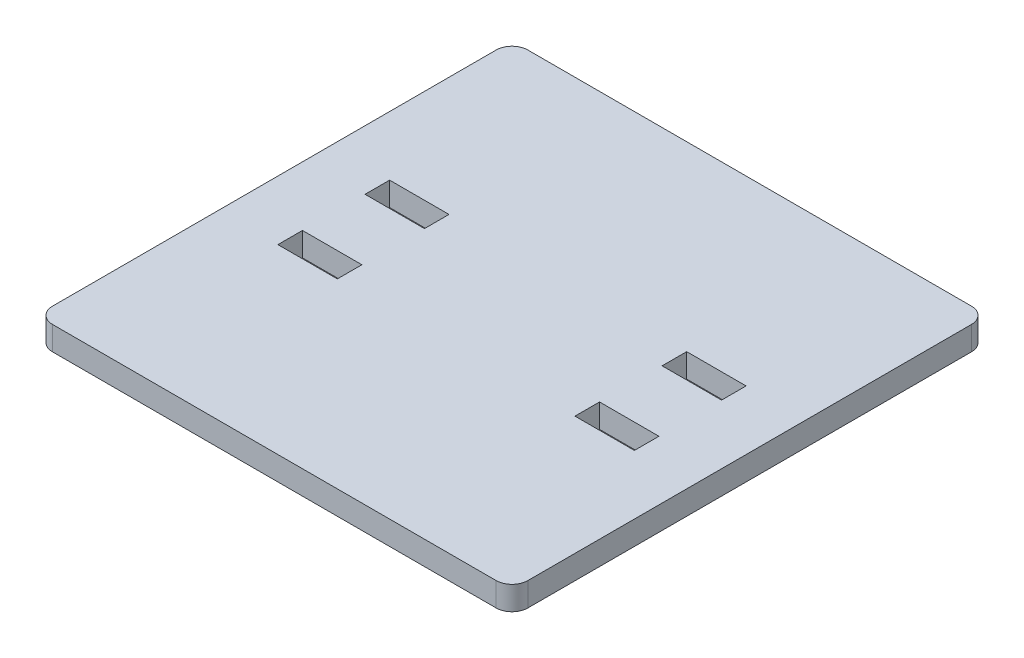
from build123d import *

# Parameters (mm, degrees)
SKETCH1_W           = 120
SKETCH1_H           = 120
BOSS_EXTRUDE1_DEPTH = 6
FILLET1_R           = 4
STRUT_SLOTS_REACH   = 87.065
SKETCH2_W           = 15
SKETCH2_H           = 6.2


with BuildPart() as part:
    # Sketch1 → Boss-Extrude1 (new body)
    with BuildSketch(Plane(origin=(0, 0, 0), x_dir=(1, 0, 0), z_dir=(0, 1, 0))):
        Rectangle(SKETCH1_W, SKETCH1_H)
    extrude(amount=BOSS_EXTRUDE1_DEPTH)

    # Fillet1
    fillet1_edges = [part.edges().sort_by_distance(p)[0] for p in [
        (-60, 3, -60),
        (60, 3, -60),
        (60, 3, 60),
        (-60, 3, 60),
    ]]
    fillet(fillet1_edges, radius=FILLET1_R)

    # Sketch2 → strut slots (cut, up to next)
    with BuildSketch(Plane(origin=(0, 6, 0), x_dir=(1, 0, 0), z_dir=(0, 1, 0)), mode=Mode.PRIVATE) as strut_slots_sk1:
        with Locations((-37.5, -11)):
            Rectangle(SKETCH2_W, SKETCH2_H)
    strut_slots_tool1 = extrude(strut_slots_sk1.sketch, amount=-STRUT_SLOTS_REACH, mode=Mode.PRIVATE) & part.part
    # Sketch2 → strut slots (cut, up to next)
    with BuildSketch(Plane(origin=(0, 6, 0), x_dir=(1, 0, 0), z_dir=(0, 1, 0)), mode=Mode.PRIVATE) as strut_slots_sk2:
        with Locations((37.5, -11)):
            Rectangle(SKETCH2_W, SKETCH2_H)
    strut_slots_tool2 = extrude(strut_slots_sk2.sketch, amount=-STRUT_SLOTS_REACH, mode=Mode.PRIVATE) & part.part
    # Sketch2 → strut slots (cut, up to next)
    with BuildSketch(Plane(origin=(0, 6, 0), x_dir=(1, 0, 0), z_dir=(0, 1, 0)), mode=Mode.PRIVATE) as strut_slots_sk3:
        with Locations((-37.5, 11)):
            Rectangle(SKETCH2_W, SKETCH2_H)
    strut_slots_tool3 = extrude(strut_slots_sk3.sketch, amount=-STRUT_SLOTS_REACH, mode=Mode.PRIVATE) & part.part
    # Sketch2 → strut slots (cut, up to next)
    with BuildSketch(Plane(origin=(0, 6, 0), x_dir=(1, 0, 0), z_dir=(0, 1, 0)), mode=Mode.PRIVATE) as strut_slots_sk4:
        with Locations((37.5, 11)):
            Rectangle(SKETCH2_W, SKETCH2_H)
    strut_slots_tool4 = extrude(strut_slots_sk4.sketch, amount=-STRUT_SLOTS_REACH, mode=Mode.PRIVATE) & part.part
    add(strut_slots_tool1.solids().sort_by_distance((-37.5, 6, 11))[0], mode=Mode.SUBTRACT)
    add(strut_slots_tool2.solids().sort_by_distance((37.5, 6, 11))[0], mode=Mode.SUBTRACT)
    add(strut_slots_tool3.solids().sort_by_distance((-37.5, 6, -11))[0], mode=Mode.SUBTRACT)
    add(strut_slots_tool4.solids().sort_by_distance((37.5, 6, -11))[0], mode=Mode.SUBTRACT)


solid = part.part
